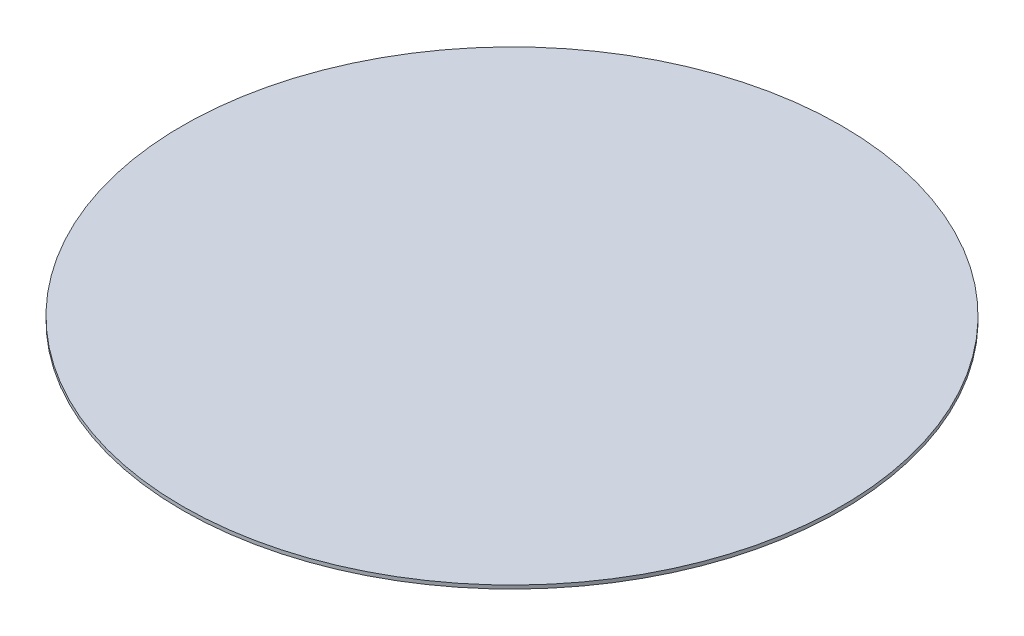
from build123d import *

# Parameters (mm, degrees)
SKETCH2_R           = 23.5
BOSS_EXTRUDE1_DEPTH = 0.25


with BuildPart() as part:
    # Sketch2 → Boss-Extrude1 (new body)
    with BuildSketch(Plane(origin=(0, 0, 0), x_dir=(1, 0, 0), z_dir=(0, 1, 0))):
        with Locations(Location((0, 0, 0), (0, 0, 270))):
            Circle(SKETCH2_R)
    extrude(amount=BOSS_EXTRUDE1_DEPTH)


solid = part.part
